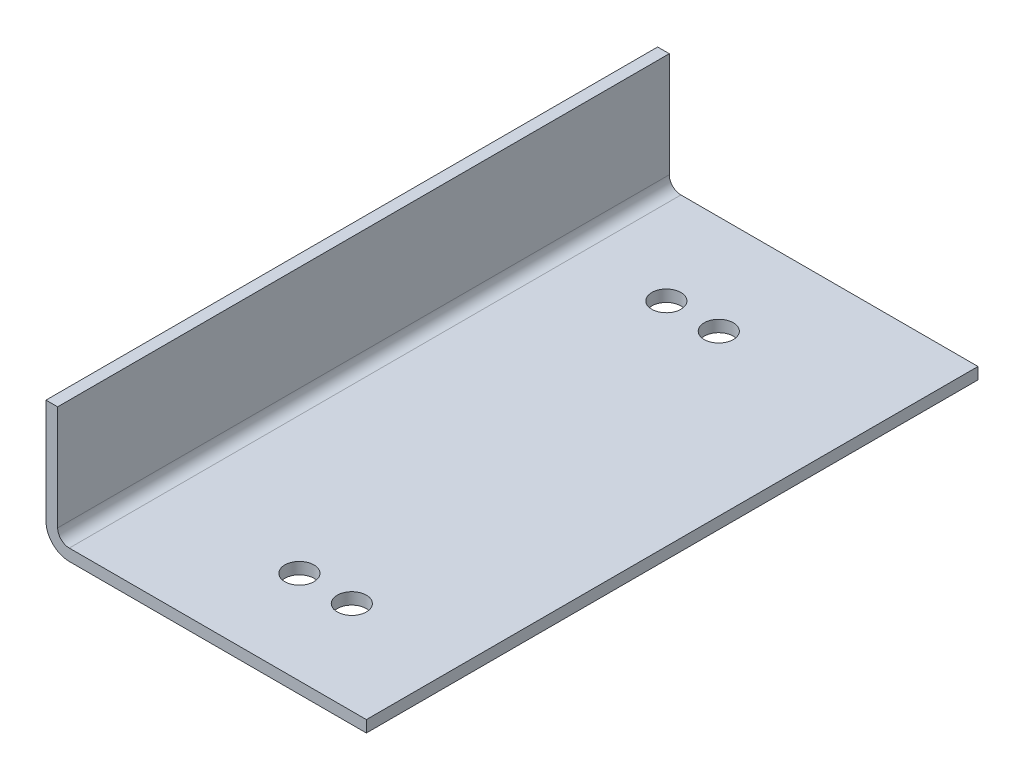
from build123d import *

# Parameters (mm, degrees)
EXTRUSION1_DEPTH        = 105
ENL_V_MAT_EXTRU_1_REACH = 122.557
ESQUISSE2_R             = 2.5


with BuildPart() as part:
    # Esquisse1 → Extrusion1 (new body)
    with BuildSketch(Plane.XY):
        with BuildLine():
            Line((0, 4), (0, 22))
            Line((0, 22), (2, 22))
            Line((2, 22), (2, 4))
            ThreePointArc((2, 4), (2.585786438, 2.585786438), (4, 2))
            Line((4, 2), (55, 2))
            Line((55, 2), (55, 0))
            Line((55, 0), (4, 0))
            ThreePointArc((4, 0), (1.171572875, 1.171572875), (0, 4))
        make_face()
    extrude(amount=EXTRUSION1_DEPTH)

    # Esquisse2 → Enl_v. mat.-Extru.1 (cut, up to next)
    with BuildSketch(Plane.XZ, mode=Mode.PRIVATE) as enl_v_mat_extru_1_sk1:
        with Locations(Location((18.5, 17, 0), (0, 0, 270))):
            Circle(ESQUISSE2_R)
    enl_v_mat_extru_1_tool1 = extrude(enl_v_mat_extru_1_sk1.sketch, amount=-ENL_V_MAT_EXTRU_1_REACH, mode=Mode.PRIVATE) & part.part
    # Esquisse2 → Enl_v. mat.-Extru.1 (cut, up to next)
    with BuildSketch(Plane.XZ, mode=Mode.PRIVATE) as enl_v_mat_extru_1_sk2:
        with Locations(Location((27.5, 17, 0), (0, 0, 270))):
            Circle(ESQUISSE2_R)
    enl_v_mat_extru_1_tool2 = extrude(enl_v_mat_extru_1_sk2.sketch, amount=-ENL_V_MAT_EXTRU_1_REACH, mode=Mode.PRIVATE) & part.part
    # Esquisse2 → Enl_v. mat.-Extru.1 (cut, up to next)
    with BuildSketch(Plane.XZ, mode=Mode.PRIVATE) as enl_v_mat_extru_1_sk3:
        with Locations(Location((36.5, 89, 0), (0, 0, 270))):
            Circle(ESQUISSE2_R)
    enl_v_mat_extru_1_tool3 = extrude(enl_v_mat_extru_1_sk3.sketch, amount=-ENL_V_MAT_EXTRU_1_REACH, mode=Mode.PRIVATE) & part.part
    # Esquisse2 → Enl_v. mat.-Extru.1 (cut, up to next)
    with BuildSketch(Plane.XZ, mode=Mode.PRIVATE) as enl_v_mat_extru_1_sk4:
        with Locations(Location((27.5, 89, 0), (0, 0, 270))):
            Circle(ESQUISSE2_R)
    enl_v_mat_extru_1_tool4 = extrude(enl_v_mat_extru_1_sk4.sketch, amount=-ENL_V_MAT_EXTRU_1_REACH, mode=Mode.PRIVATE) & part.part
    add(enl_v_mat_extru_1_tool1.solids().sort_by_distance((18.5, 0, 17))[0], mode=Mode.SUBTRACT)
    add(enl_v_mat_extru_1_tool2.solids().sort_by_distance((27.5, 0, 17))[0], mode=Mode.SUBTRACT)
    add(enl_v_mat_extru_1_tool3.solids().sort_by_distance((36.5, 0, 89))[0], mode=Mode.SUBTRACT)
    add(enl_v_mat_extru_1_tool4.solids().sort_by_distance((27.5, 0, 89))[0], mode=Mode.SUBTRACT)


solid = part.part
